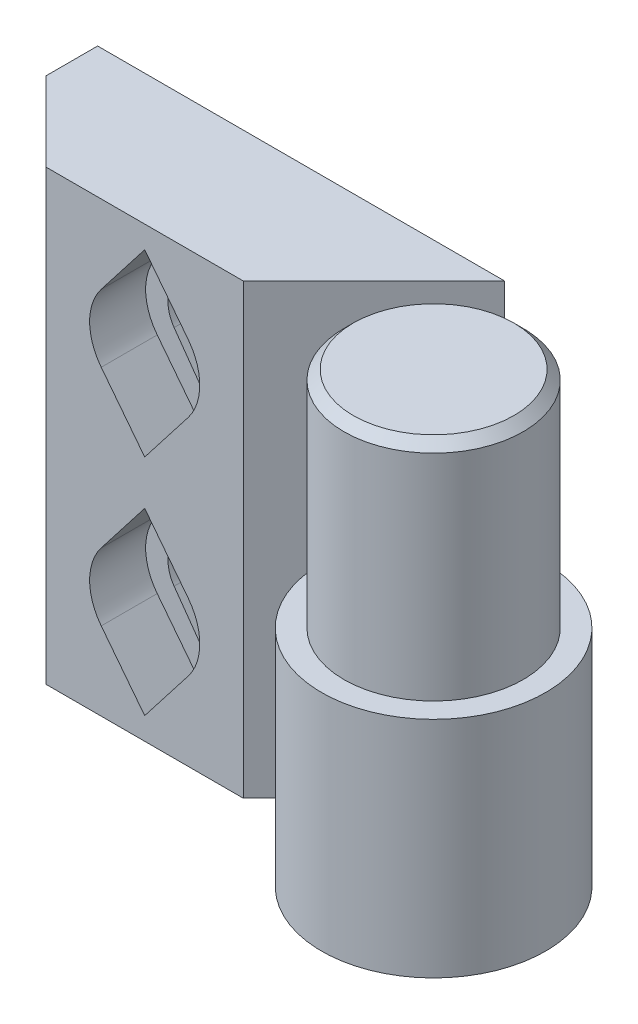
ISO-10303-21;
HEADER;
FILE_DESCRIPTION(('STEP AP214'),'2;1');
FILE_NAME('part.step','',(''),(''),'','','');
FILE_SCHEMA(('AUTOMOTIVE_DESIGN { 1 0 10303 214 1 1 1 1 }'));
ENDSEC;
DATA;
#1=APPLICATION_CONTEXT('core data for automotive mechanical design processes');
#2=APPLICATION_PROTOCOL_DEFINITION('international standard','automotive_design',2000,#1);
#3=PRODUCT_CONTEXT('',#1,'mechanical');
#4=PRODUCT('Part','Part','',(#3));
#5=PRODUCT_RELATED_PRODUCT_CATEGORY('part','',(#4));
#6=PRODUCT_DEFINITION_FORMATION('','',#4);
#7=PRODUCT_DEFINITION_CONTEXT('part definition',#1,'design');
#8=PRODUCT_DEFINITION('design','',#6,#7);
#9=PRODUCT_DEFINITION_SHAPE('','',#8);
#10=(LENGTH_UNIT() NAMED_UNIT(*) SI_UNIT(.MILLI.,.METRE.));
#11=(NAMED_UNIT(*) PLANE_ANGLE_UNIT() SI_UNIT($,.RADIAN.));
#12=(NAMED_UNIT(*) SI_UNIT($,.STERADIAN.) SOLID_ANGLE_UNIT());
#13=UNCERTAINTY_MEASURE_WITH_UNIT(LENGTH_MEASURE(1.E-05),#10,'distance_accuracy_value','');
#14=(GEOMETRIC_REPRESENTATION_CONTEXT(3) GLOBAL_UNCERTAINTY_ASSIGNED_CONTEXT((#13)) GLOBAL_UNIT_ASSIGNED_CONTEXT((#10,
#11,#12)) REPRESENTATION_CONTEXT('',''));
#15=CARTESIAN_POINT('',(0.,0.,0.));
#16=DIRECTION('',(0.,0.,1.));
#17=DIRECTION('',(1.,0.,0.));
#18=AXIS2_PLACEMENT_3D('',#15,#16,#17);
#19=CARTESIAN_POINT('',(0.,0.,-2.));
#20=DIRECTION('',(0.,0.,1.));
#21=DIRECTION('',(1.,0.,0.));
#22=AXIS2_PLACEMENT_3D('',#19,#20,#21);
#23=PLANE('',#22);
#24=DIRECTION('',(0.613374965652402,-0.789791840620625,0.));
#25=VECTOR('',#24,1.);
#26=CARTESIAN_POINT('',(2.01877343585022,1.56783727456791,-2.));
#27=LINE('',#26,#25);
#28=CARTESIAN_POINT('',(-14.4780762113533,22.8094561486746,-2.));
#29=VERTEX_POINT('',#28);
#30=CARTESIAN_POINT('',(-12.1481902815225,19.8094561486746,-2.));
#31=VERTEX_POINT('',#30);
#32=EDGE_CURVE('E336',#29,#31,#27,.T.);
#33=ORIENTED_EDGE('',*,*,#32,.F.);
#34=DIRECTION('',(0.613374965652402,0.789791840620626,0.));
#35=VECTOR('',#34,1.);
#36=CARTESIAN_POINT('',(-20.0807859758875,15.5953135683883,-2.));
#37=LINE('',#36,#35);
#38=CARTESIAN_POINT('',(-16.8079621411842,19.8094561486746,-2.));
#39=VERTEX_POINT('',#38);
#40=EDGE_CURVE('E338',#39,#29,#37,.T.);
#41=ORIENTED_EDGE('',*,*,#40,.F.);
#42=CARTESIAN_POINT('',(-14.4780762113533,18.,-2.));
#43=DIRECTION('',(0.,0.,1.));
#44=DIRECTION('',(1.,0.,0.));
#45=AXIS2_PLACEMENT_3D('',#42,#43,#44);
#46=CIRCLE('',#45,2.95);
#47=CARTESIAN_POINT('',(-16.8079621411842,16.1905438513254,-2.));
#48=VERTEX_POINT('',#47);
#49=EDGE_CURVE('E341',#39,#48,#46,.T.);
#50=ORIENTED_EDGE('',*,*,#49,.T.);
#51=DIRECTION('',(0.613374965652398,-0.789791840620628,0.));
#52=VECTOR('',#51,1.);
#53=CARTESIAN_POINT('',(-2.64099842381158,-2.05107502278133,-2.));
#54=LINE('',#53,#52);
#55=CARTESIAN_POINT('',(-14.4780762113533,13.1905438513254,-2.));
#56=VERTEX_POINT('',#55);
#57=EDGE_CURVE('E344',#48,#56,#54,.T.);
#58=ORIENTED_EDGE('',*,*,#57,.T.);
#59=DIRECTION('',(0.613374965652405,0.789791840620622,0.));
#60=VECTOR('',#59,1.);
#61=CARTESIAN_POINT('',(-15.4210141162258,11.9764012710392,-2.));
#62=LINE('',#61,#60);
#63=CARTESIAN_POINT('',(-12.1481902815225,16.1905438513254,-2.));
#64=VERTEX_POINT('',#63);
#65=EDGE_CURVE('E347',#56,#64,#62,.T.);
#66=ORIENTED_EDGE('',*,*,#65,.T.);
#67=CARTESIAN_POINT('',(-14.4780762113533,18.,-2.));
#68=DIRECTION('',(0.,0.,1.));
#69=DIRECTION('',(1.,0.,0.));
#70=AXIS2_PLACEMENT_3D('',#67,#68,#69);
#71=CIRCLE('',#70,2.95);
#72=EDGE_CURVE('E350',#64,#31,#71,.T.);
#73=ORIENTED_EDGE('',*,*,#72,.T.);
#74=EDGE_LOOP('',(#33,#41,#50,#58,#66,#73));
#75=FACE_BOUND('',#74,.T.);
#76=DIRECTION('',(0.580322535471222,0.814386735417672,0.));
#77=VECTOR('',#76,1.);
#78=CARTESIAN_POINT('',(-19.5343353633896,13.9199406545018,-2.));
#79=LINE('',#78,#77);
#80=CARTESIAN_POINT('',(-15.9032529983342,19.0155644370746,-2.));
#81=VERTEX_POINT('',#80);
#82=CARTESIAN_POINT('',(-14.4780762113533,21.0155644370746,-2.));
#83=VERTEX_POINT('',#82);
#84=EDGE_CURVE('E307',#81,#83,#79,.T.);
#85=ORIENTED_EDGE('',*,*,#84,.T.);
#86=DIRECTION('',(0.580322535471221,-0.814386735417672,0.));
#87=VECTOR('',#86,1.);
#88=CARTESIAN_POINT('',(0.32986931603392,0.235061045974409,-2.));
#89=LINE('',#88,#87);
#90=CARTESIAN_POINT('',(-13.0528994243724,19.0155644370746,-2.));
#91=VERTEX_POINT('',#90);
#92=EDGE_CURVE('E304',#83,#91,#89,.T.);
#93=ORIENTED_EDGE('',*,*,#92,.T.);
#94=CARTESIAN_POINT('',(-14.4780762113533,18.,-2.));
#95=DIRECTION('',(0.,0.,1.));
#96=DIRECTION('',(1.,0.,0.));
#97=AXIS2_PLACEMENT_3D('',#94,#95,#96);
#98=CIRCLE('',#97,1.75);
#99=CARTESIAN_POINT('',(-13.0528994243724,16.9844355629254,-2.));
#100=VERTEX_POINT('',#99);
#101=EDGE_CURVE('E317',#100,#91,#98,.T.);
#102=ORIENTED_EDGE('',*,*,#101,.F.);
#103=DIRECTION('',(0.580322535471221,0.814386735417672,0.));
#104=VECTOR('',#103,1.);
#105=CARTESIAN_POINT('',(-16.6839817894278,11.8888117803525,-2.));
#106=LINE('',#105,#104);
#107=CARTESIAN_POINT('',(-14.4780762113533,14.9844355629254,-2.));
#108=VERTEX_POINT('',#107);
#109=EDGE_CURVE('E55',#108,#100,#106,.T.);
#110=ORIENTED_EDGE('',*,*,#109,.F.);
#111=DIRECTION('',(0.580322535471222,-0.814386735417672,0.));
#112=VECTOR('',#111,1.);
#113=CARTESIAN_POINT('',(-2.52048425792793,-1.79606782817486,-2.));
#114=LINE('',#113,#112);
#115=CARTESIAN_POINT('',(-15.9032529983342,16.9844355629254,-2.));
#116=VERTEX_POINT('',#115);
#117=EDGE_CURVE('E313',#116,#108,#114,.T.);
#118=ORIENTED_EDGE('',*,*,#117,.F.);
#119=CARTESIAN_POINT('',(-14.4780762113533,18.,-2.));
#120=DIRECTION('',(0.,0.,1.));
#121=DIRECTION('',(1.,0.,0.));
#122=AXIS2_PLACEMENT_3D('',#119,#120,#121);
#123=CIRCLE('',#122,1.75);
#124=EDGE_CURVE('E310',#81,#116,#123,.T.);
#125=ORIENTED_EDGE('',*,*,#124,.F.);
#126=EDGE_LOOP('',(#85,#93,#102,#110,#118,#125));
#127=FACE_BOUND('',#126,.T.);
#128=ADVANCED_FACE('F40',(#75,#127),#23,.T.);
#129=CARTESIAN_POINT('',(-24.,36.1867732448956,-6.));
#130=DIRECTION('',(0.,0.,1.));
#131=DIRECTION('',(1.,0.,0.));
#132=AXIS2_PLACEMENT_3D('',#129,#130,#131);
#133=PLANE('',#132);
#134=DIRECTION('',(-0.580322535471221,0.814386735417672,0.));
#135=VECTOR('',#134,1.);
#136=CARTESIAN_POINT('',(0.32986931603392,0.235061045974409,-6.));
#137=LINE('',#136,#135);
#138=CARTESIAN_POINT('',(-13.0528994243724,19.0155644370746,-6.));
#139=VERTEX_POINT('',#138);
#140=CARTESIAN_POINT('',(-14.4780762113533,21.0155644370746,-6.));
#141=VERTEX_POINT('',#140);
#142=EDGE_CURVE('E301',#139,#141,#137,.T.);
#143=ORIENTED_EDGE('',*,*,#142,.T.);
#144=DIRECTION('',(-0.580322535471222,-0.814386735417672,0.));
#145=VECTOR('',#144,1.);
#146=CARTESIAN_POINT('',(-19.5343353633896,13.9199406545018,-6.));
#147=LINE('',#146,#145);
#148=CARTESIAN_POINT('',(-15.9032529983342,19.0155644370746,-6.));
#149=VERTEX_POINT('',#148);
#150=EDGE_CURVE('E323',#141,#149,#147,.T.);
#151=ORIENTED_EDGE('',*,*,#150,.T.);
#152=CARTESIAN_POINT('',(-14.4780762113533,18.,-6.));
#153=DIRECTION('',(0.,0.,1.));
#154=DIRECTION('',(1.,0.,0.));
#155=AXIS2_PLACEMENT_3D('',#152,#153,#154);
#156=CIRCLE('',#155,1.75);
#157=CARTESIAN_POINT('',(-15.9032529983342,16.9844355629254,-6.));
#158=VERTEX_POINT('',#157);
#159=EDGE_CURVE('E292',#158,#149,#156,.F.);
#160=ORIENTED_EDGE('',*,*,#159,.F.);
#161=DIRECTION('',(-0.580322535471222,0.814386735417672,0.));
#162=VECTOR('',#161,1.);
#163=CARTESIAN_POINT('',(-2.52048425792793,-1.79606782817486,-6.));
#164=LINE('',#163,#162);
#165=CARTESIAN_POINT('',(-14.4780762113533,14.9844355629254,-6.));
#166=VERTEX_POINT('',#165);
#167=EDGE_CURVE('E295',#166,#158,#164,.T.);
#168=ORIENTED_EDGE('',*,*,#167,.F.);
#169=DIRECTION('',(-0.580322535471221,-0.814386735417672,0.));
#170=VECTOR('',#169,1.);
#171=CARTESIAN_POINT('',(-16.6839817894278,11.8888117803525,-6.));
#172=LINE('',#171,#170);
#173=CARTESIAN_POINT('',(-13.0528994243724,16.9844355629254,-6.));
#174=VERTEX_POINT('',#173);
#175=EDGE_CURVE('E297',#174,#166,#172,.T.);
#176=ORIENTED_EDGE('',*,*,#175,.F.);
#177=CARTESIAN_POINT('',(-14.4780762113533,18.,-6.));
#178=DIRECTION('',(0.,0.,1.));
#179=DIRECTION('',(1.,0.,0.));
#180=AXIS2_PLACEMENT_3D('',#177,#178,#179);
#181=CIRCLE('',#180,1.75);
#182=EDGE_CURVE('E299',#139,#174,#181,.F.);
#183=ORIENTED_EDGE('',*,*,#182,.F.);
#184=EDGE_LOOP('',(#143,#151,#160,#168,#176,#183));
#185=FACE_BOUND('',#184,.T.);
#186=DIRECTION('',(-1.,0.,0.));
#187=VECTOR('',#186,1.);
#188=CARTESIAN_POINT('',(-24.,12.,-6.));
#189=LINE('',#188,#187);
#190=CARTESIAN_POINT('',(0.,12.,-6.));
#191=VERTEX_POINT('',#190);
#192=CARTESIAN_POINT('',(-2.19615242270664,12.,-6.));
#193=VERTEX_POINT('',#192);
#194=EDGE_CURVE('E461',#191,#193,#189,.T.);
#195=ORIENTED_EDGE('',*,*,#194,.F.);
#196=DIRECTION('',(0.,-1.,0.));
#197=VECTOR('',#196,1.);
#198=CARTESIAN_POINT('',(0.,36.1867732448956,-6.));
#199=LINE('',#198,#197);
#200=CARTESIAN_POINT('',(0.,0.,-6.));
#201=VERTEX_POINT('',#200);
#202=EDGE_CURVE('E444',#191,#201,#199,.T.);
#203=ORIENTED_EDGE('',*,*,#202,.T.);
#204=DIRECTION('',(-1.,0.,0.));
#205=VECTOR('',#204,1.);
#206=CARTESIAN_POINT('',(-24.,0.,-6.));
#207=LINE('',#206,#205);
#208=CARTESIAN_POINT('',(-24.,0.,-6.));
#209=VERTEX_POINT('',#208);
#210=EDGE_CURVE('E458',#201,#209,#207,.T.);
#211=ORIENTED_EDGE('',*,*,#210,.T.);
#212=DIRECTION('',(0.,-1.,0.));
#213=VECTOR('',#212,1.);
#214=CARTESIAN_POINT('',(-24.,36.1867732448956,-6.));
#215=LINE('',#214,#213);
#216=CARTESIAN_POINT('',(-24.,24.,-6.));
#217=VERTEX_POINT('',#216);
#218=EDGE_CURVE('E457',#217,#209,#215,.T.);
#219=ORIENTED_EDGE('',*,*,#218,.F.);
#220=DIRECTION('',(-1.,0.,0.));
#221=VECTOR('',#220,1.);
#222=CARTESIAN_POINT('',(-2.19615242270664,24.,-6.));
#223=LINE('',#222,#221);
#224=CARTESIAN_POINT('',(-2.19615242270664,24.,-6.));
#225=VERTEX_POINT('',#224);
#226=EDGE_CURVE('E448',#225,#217,#223,.T.);
#227=ORIENTED_EDGE('',*,*,#226,.F.);
#228=DIRECTION('',(0.,-1.,0.));
#229=VECTOR('',#228,1.);
#230=CARTESIAN_POINT('',(-2.19615242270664,46.0092655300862,-6.));
#231=LINE('',#230,#229);
#232=EDGE_CURVE('E440',#225,#193,#231,.T.);
#233=ORIENTED_EDGE('',*,*,#232,.T.);
#234=EDGE_LOOP('',(#195,#203,#211,#219,#227,#233));
#235=FACE_BOUND('',#234,.T.);
#236=CARTESIAN_POINT('',(-14.4780762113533,6.,-6.));
#237=DIRECTION('',(0.,0.,1.));
#238=DIRECTION('',(1.,0.,0.));
#239=AXIS2_PLACEMENT_3D('',#236,#237,#238);
#240=CIRCLE('',#239,1.75);
#241=CARTESIAN_POINT('',(-13.0528994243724,4.98443556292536,-6.));
#242=VERTEX_POINT('',#241);
#243=CARTESIAN_POINT('',(-13.0528994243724,7.01556443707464,-6.));
#244=VERTEX_POINT('',#243);
#245=EDGE_CURVE('E255',#242,#244,#240,.T.);
#246=ORIENTED_EDGE('',*,*,#245,.T.);
#247=DIRECTION('',(-0.580322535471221,0.814386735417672,0.));
#248=VECTOR('',#247,1.);
#249=CARTESIAN_POINT('',(-5.34141438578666,-3.80622989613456,-6.));
#250=LINE('',#249,#248);
#251=CARTESIAN_POINT('',(-14.4780762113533,9.01556443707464,-6.));
#252=VERTEX_POINT('',#251);
#253=EDGE_CURVE('E242',#244,#252,#250,.T.);
#254=ORIENTED_EDGE('',*,*,#253,.T.);
#255=DIRECTION('',(-0.580322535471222,-0.814386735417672,0.));
#256=VECTOR('',#255,1.);
#257=CARTESIAN_POINT('',(-13.8630516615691,9.8786497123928,-6.));
#258=LINE('',#257,#256);
#259=CARTESIAN_POINT('',(-15.9032529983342,7.01556443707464,-6.));
#260=VERTEX_POINT('',#259);
#261=EDGE_CURVE('E335',#252,#260,#258,.T.);
#262=ORIENTED_EDGE('',*,*,#261,.T.);
#263=CARTESIAN_POINT('',(-14.4780762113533,6.,-6.));
#264=DIRECTION('',(0.,0.,1.));
#265=DIRECTION('',(1.,0.,0.));
#266=AXIS2_PLACEMENT_3D('',#263,#264,#265);
#267=CIRCLE('',#266,1.75);
#268=CARTESIAN_POINT('',(-15.9032529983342,4.98443556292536,-6.));
#269=VERTEX_POINT('',#268);
#270=EDGE_CURVE('E665',#260,#269,#267,.T.);
#271=ORIENTED_EDGE('',*,*,#270,.T.);
#272=DIRECTION('',(-0.580322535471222,0.814386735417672,0.));
#273=VECTOR('',#272,1.);
#274=CARTESIAN_POINT('',(-8.1917679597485,-5.83735877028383,-6.));
#275=LINE('',#274,#273);
#276=CARTESIAN_POINT('',(-14.4780762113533,2.98443556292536,-6.));
#277=VERTEX_POINT('',#276);
#278=EDGE_CURVE('E268',#277,#269,#275,.T.);
#279=ORIENTED_EDGE('',*,*,#278,.F.);
#280=DIRECTION('',(-0.580322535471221,-0.814386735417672,0.));
#281=VECTOR('',#280,1.);
#282=CARTESIAN_POINT('',(-11.0126980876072,7.84752083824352,-6.));
#283=LINE('',#282,#281);
#284=EDGE_CURVE('E264',#242,#277,#283,.T.);
#285=ORIENTED_EDGE('',*,*,#284,.F.);
#286=EDGE_LOOP('',(#246,#254,#262,#271,#279,#285));
#287=FACE_BOUND('',#286,.T.);
#288=ADVANCED_FACE('F262',(#185,#235,#287),#133,.F.);
#289=CARTESIAN_POINT('',(-14.4780762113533,6.,-2.));
#290=DIRECTION('',(0.,0.,-1.));
#291=DIRECTION('',(-1.,0.,0.));
#292=AXIS2_PLACEMENT_3D('',#289,#290,#291);
#293=PLANE('',#292);
#294=DIRECTION('',(0.613374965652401,-0.789791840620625,0.));
#295=VECTOR('',#294,1.);
#296=CARTESIAN_POINT('',(-16.8079621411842,4.19054385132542,-2.));
#297=LINE('',#296,#295);
#298=CARTESIAN_POINT('',(-16.8079621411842,4.19054385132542,-2.));
#299=VERTEX_POINT('',#298);
#300=CARTESIAN_POINT('',(-14.4780762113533,1.19054385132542,-2.));
#301=VERTEX_POINT('',#300);
#302=EDGE_CURVE('E402',#299,#301,#297,.T.);
#303=ORIENTED_EDGE('',*,*,#302,.T.);
#304=DIRECTION('',(0.613374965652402,0.789791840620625,0.));
#305=VECTOR('',#304,1.);
#306=CARTESIAN_POINT('',(-14.4780762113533,1.19054385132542,-2.));
#307=LINE('',#306,#305);
#308=CARTESIAN_POINT('',(-12.1481902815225,4.19054385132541,-2.));
#309=VERTEX_POINT('',#308);
#310=EDGE_CURVE('E422',#301,#309,#307,.T.);
#311=ORIENTED_EDGE('',*,*,#310,.T.);
#312=CARTESIAN_POINT('',(-14.4780762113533,6.,-2.));
#313=DIRECTION('',(0.,0.,-1.));
#314=DIRECTION('',(-1.,0.,0.));
#315=AXIS2_PLACEMENT_3D('',#312,#313,#314);
#316=CIRCLE('',#315,2.95);
#317=CARTESIAN_POINT('',(-12.1481902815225,7.8094561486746,-2.));
#318=VERTEX_POINT('',#317);
#319=EDGE_CURVE('E420',#318,#309,#316,.T.);
#320=ORIENTED_EDGE('',*,*,#319,.F.);
#321=DIRECTION('',(0.613374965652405,-0.789791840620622,0.));
#322=VECTOR('',#321,1.);
#323=CARTESIAN_POINT('',(-14.4780762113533,10.8094561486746,-2.));
#324=LINE('',#323,#322);
#325=CARTESIAN_POINT('',(-14.4780762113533,10.8094561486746,-2.));
#326=VERTEX_POINT('',#325);
#327=EDGE_CURVE('E418',#326,#318,#324,.T.);
#328=ORIENTED_EDGE('',*,*,#327,.F.);
#329=DIRECTION('',(0.613374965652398,0.789791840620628,0.));
#330=VECTOR('',#329,1.);
#331=CARTESIAN_POINT('',(-16.8079621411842,7.80945614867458,-2.));
#332=LINE('',#331,#330);
#333=CARTESIAN_POINT('',(-16.8079621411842,7.80945614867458,-2.));
#334=VERTEX_POINT('',#333);
#335=EDGE_CURVE('E416',#334,#326,#332,.T.);
#336=ORIENTED_EDGE('',*,*,#335,.F.);
#337=CARTESIAN_POINT('',(-14.4780762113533,6.,-2.));
#338=DIRECTION('',(0.,0.,-1.));
#339=DIRECTION('',(-1.,0.,0.));
#340=AXIS2_PLACEMENT_3D('',#337,#338,#339);
#341=CIRCLE('',#340,2.95);
#342=EDGE_CURVE('E388',#299,#334,#341,.T.);
#343=ORIENTED_EDGE('',*,*,#342,.F.);
#344=EDGE_LOOP('',(#303,#311,#320,#328,#336,#343));
#345=FACE_BOUND('',#344,.T.);
#346=CARTESIAN_POINT('',(-14.4780762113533,6.,-2.));
#347=DIRECTION('',(0.,0.,1.));
#348=DIRECTION('',(1.,0.,0.));
#349=AXIS2_PLACEMENT_3D('',#346,#347,#348);
#350=CIRCLE('',#349,1.75);
#351=CARTESIAN_POINT('',(-13.0528994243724,7.01556443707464,-2.));
#352=VERTEX_POINT('',#351);
#353=CARTESIAN_POINT('',(-13.0528994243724,4.98443556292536,-2.));
#354=VERTEX_POINT('',#353);
#355=EDGE_CURVE('E258',#352,#354,#350,.F.);
#356=ORIENTED_EDGE('',*,*,#355,.T.);
#357=DIRECTION('',(0.580322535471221,0.814386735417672,0.));
#358=VECTOR('',#357,1.);
#359=CARTESIAN_POINT('',(-11.0126980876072,7.84752083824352,-2.));
#360=LINE('',#359,#358);
#361=CARTESIAN_POINT('',(-14.4780762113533,2.98443556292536,-2.));
#362=VERTEX_POINT('',#361);
#363=EDGE_CURVE('E259',#362,#354,#360,.T.);
#364=ORIENTED_EDGE('',*,*,#363,.F.);
#365=DIRECTION('',(0.580322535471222,-0.814386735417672,0.));
#366=VECTOR('',#365,1.);
#367=CARTESIAN_POINT('',(-8.1917679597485,-5.83735877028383,-2.));
#368=LINE('',#367,#366);
#369=CARTESIAN_POINT('',(-15.9032529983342,4.98443556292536,-2.));
#370=VERTEX_POINT('',#369);
#371=EDGE_CURVE('E279',#370,#362,#368,.T.);
#372=ORIENTED_EDGE('',*,*,#371,.F.);
#373=CARTESIAN_POINT('',(-14.4780762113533,6.,-2.));
#374=DIRECTION('',(0.,0.,1.));
#375=DIRECTION('',(1.,0.,0.));
#376=AXIS2_PLACEMENT_3D('',#373,#374,#375);
#377=CIRCLE('',#376,1.75);
#378=CARTESIAN_POINT('',(-15.9032529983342,7.01556443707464,-2.));
#379=VERTEX_POINT('',#378);
#380=EDGE_CURVE('E276',#370,#379,#377,.F.);
#381=ORIENTED_EDGE('',*,*,#380,.T.);
#382=DIRECTION('',(0.580322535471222,0.814386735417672,0.));
#383=VECTOR('',#382,1.);
#384=CARTESIAN_POINT('',(-13.8630516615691,9.8786497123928,-2.));
#385=LINE('',#384,#383);
#386=CARTESIAN_POINT('',(-14.4780762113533,9.01556443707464,-2.));
#387=VERTEX_POINT('',#386);
#388=EDGE_CURVE('E273',#379,#387,#385,.T.);
#389=ORIENTED_EDGE('',*,*,#388,.T.);
#390=DIRECTION('',(0.580322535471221,-0.814386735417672,0.));
#391=VECTOR('',#390,1.);
#392=CARTESIAN_POINT('',(-5.34141438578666,-3.80622989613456,-2.));
#393=LINE('',#392,#391);
#394=EDGE_CURVE('E266',#387,#352,#393,.T.);
#395=ORIENTED_EDGE('',*,*,#394,.T.);
#396=EDGE_LOOP('',(#356,#364,#372,#381,#389,#395));
#397=FACE_BOUND('',#396,.T.);
#398=ADVANCED_FACE('F518',(#345,#397),#293,.F.);
#399=CARTESIAN_POINT('',(-9.19615242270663,43.2245853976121,0.999999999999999));
#400=DIRECTION('',(0.,0.,1.));
#401=DIRECTION('',(1.,0.,0.));
#402=AXIS2_PLACEMENT_3D('',#399,#400,#401);
#403=PLANE('',#402);
#404=DIRECTION('',(0.613374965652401,-0.789791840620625,0.));
#405=VECTOR('',#404,1.);
#406=CARTESIAN_POINT('',(-16.8079621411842,4.19054385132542,1.));
#407=LINE('',#406,#405);
#408=CARTESIAN_POINT('',(-16.8079621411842,4.19054385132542,1.));
#409=VERTEX_POINT('',#408);
#410=CARTESIAN_POINT('',(-14.4780762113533,1.19054385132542,0.999999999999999));
#411=VERTEX_POINT('',#410);
#412=EDGE_CURVE('E358',#409,#411,#407,.T.);
#413=ORIENTED_EDGE('',*,*,#412,.F.);
#414=CARTESIAN_POINT('',(-14.4780762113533,6.,1.));
#415=DIRECTION('',(0.,0.,-1.));
#416=DIRECTION('',(-1.,0.,0.));
#417=AXIS2_PLACEMENT_3D('',#414,#415,#416);
#418=CIRCLE('',#417,2.95);
#419=CARTESIAN_POINT('',(-16.8079621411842,7.80945614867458,1.));
#420=VERTEX_POINT('',#419);
#421=EDGE_CURVE('E398',#409,#420,#418,.T.);
#422=ORIENTED_EDGE('',*,*,#421,.T.);
#423=DIRECTION('',(0.613374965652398,0.789791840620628,0.));
#424=VECTOR('',#423,1.);
#425=CARTESIAN_POINT('',(-16.8079621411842,7.80945614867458,1.));
#426=LINE('',#425,#424);
#427=CARTESIAN_POINT('',(-14.4780762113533,10.8094561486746,1.));
#428=VERTEX_POINT('',#427);
#429=EDGE_CURVE('E401',#420,#428,#426,.T.);
#430=ORIENTED_EDGE('',*,*,#429,.T.);
#431=DIRECTION('',(0.613374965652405,-0.789791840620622,0.));
#432=VECTOR('',#431,1.);
#433=CARTESIAN_POINT('',(-14.4780762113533,10.8094561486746,1.));
#434=LINE('',#433,#432);
#435=CARTESIAN_POINT('',(-12.1481902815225,7.8094561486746,1.));
#436=VERTEX_POINT('',#435);
#437=EDGE_CURVE('E405',#428,#436,#434,.T.);
#438=ORIENTED_EDGE('',*,*,#437,.T.);
#439=CARTESIAN_POINT('',(-14.4780762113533,6.,1.));
#440=DIRECTION('',(0.,0.,-1.));
#441=DIRECTION('',(-1.,0.,0.));
#442=AXIS2_PLACEMENT_3D('',#439,#440,#441);
#443=CIRCLE('',#442,2.95);
#444=CARTESIAN_POINT('',(-12.1481902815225,4.19054385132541,1.));
#445=VERTEX_POINT('',#444);
#446=EDGE_CURVE('E408',#436,#445,#443,.T.);
#447=ORIENTED_EDGE('',*,*,#446,.T.);
#448=DIRECTION('',(0.613374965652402,0.789791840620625,0.));
#449=VECTOR('',#448,1.);
#450=CARTESIAN_POINT('',(-14.4780762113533,1.19054385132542,1.));
#451=LINE('',#450,#449);
#452=EDGE_CURVE('E411',#411,#445,#451,.T.);
#453=ORIENTED_EDGE('',*,*,#452,.F.);
#454=EDGE_LOOP('',(#413,#422,#430,#438,#447,#453));
#455=FACE_BOUND('',#454,.T.);
#456=DIRECTION('',(-1.,0.,0.));
#457=VECTOR('',#456,1.);
#458=CARTESIAN_POINT('',(-9.19615242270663,24.,0.999999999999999));
#459=LINE('',#458,#457);
#460=CARTESIAN_POINT('',(-9.19615242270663,24.,0.999999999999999));
#461=VERTEX_POINT('',#460);
#462=CARTESIAN_POINT('',(-19.76,24.,0.999999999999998));
#463=VERTEX_POINT('',#462);
#464=EDGE_CURVE('E433',#461,#463,#459,.T.);
#465=ORIENTED_EDGE('',*,*,#464,.T.);
#466=DIRECTION('',(0.,-1.,0.));
#467=VECTOR('',#466,1.);
#468=CARTESIAN_POINT('',(-19.76,0.,0.999999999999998));
#469=LINE('',#468,#467);
#470=CARTESIAN_POINT('',(-19.76,0.,0.999999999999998));
#471=VERTEX_POINT('',#470);
#472=EDGE_CURVE('E482',#463,#471,#469,.T.);
#473=ORIENTED_EDGE('',*,*,#472,.T.);
#474=DIRECTION('',(-1.,0.,0.));
#475=VECTOR('',#474,1.);
#476=CARTESIAN_POINT('',(-9.19615242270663,0.,0.999999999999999));
#477=LINE('',#476,#475);
#478=CARTESIAN_POINT('',(-9.19615242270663,0.,0.999999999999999));
#479=VERTEX_POINT('',#478);
#480=EDGE_CURVE('E427',#479,#471,#477,.T.);
#481=ORIENTED_EDGE('',*,*,#480,.F.);
#482=DIRECTION('',(0.,-1.,0.));
#483=VECTOR('',#482,1.);
#484=CARTESIAN_POINT('',(-9.19615242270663,43.2245853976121,0.999999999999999));
#485=LINE('',#484,#483);
#486=EDGE_CURVE('E430',#461,#479,#485,.T.);
#487=ORIENTED_EDGE('',*,*,#486,.F.);
#488=EDGE_LOOP('',(#465,#473,#481,#487));
#489=FACE_BOUND('',#488,.T.);
#490=DIRECTION('',(0.613374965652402,0.789791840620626,0.));
#491=VECTOR('',#490,1.);
#492=CARTESIAN_POINT('',(-20.0807859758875,15.5953135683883,1.));
#493=LINE('',#492,#491);
#494=CARTESIAN_POINT('',(-16.8079621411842,19.8094561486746,1.));
#495=VERTEX_POINT('',#494);
#496=CARTESIAN_POINT('',(-14.4780762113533,22.8094561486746,0.999999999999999));
#497=VERTEX_POINT('',#496);
#498=EDGE_CURVE('E357',#495,#497,#493,.T.);
#499=ORIENTED_EDGE('',*,*,#498,.T.);
#500=DIRECTION('',(0.613374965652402,-0.789791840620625,0.));
#501=VECTOR('',#500,1.);
#502=CARTESIAN_POINT('',(2.01877343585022,1.56783727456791,1.));
#503=LINE('',#502,#501);
#504=CARTESIAN_POINT('',(-12.1481902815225,19.8094561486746,1.));
#505=VERTEX_POINT('',#504);
#506=EDGE_CURVE('E354',#497,#505,#503,.T.);
#507=ORIENTED_EDGE('',*,*,#506,.T.);
#508=CARTESIAN_POINT('',(-14.4780762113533,18.,1.));
#509=DIRECTION('',(0.,0.,1.));
#510=DIRECTION('',(1.,0.,0.));
#511=AXIS2_PLACEMENT_3D('',#508,#509,#510);
#512=CIRCLE('',#511,2.95);
#513=CARTESIAN_POINT('',(-12.1481902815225,16.1905438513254,1.));
#514=VERTEX_POINT('',#513);
#515=EDGE_CURVE('E339',#514,#505,#512,.T.);
#516=ORIENTED_EDGE('',*,*,#515,.F.);
#517=DIRECTION('',(0.613374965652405,0.789791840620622,0.));
#518=VECTOR('',#517,1.);
#519=CARTESIAN_POINT('',(-15.4210141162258,11.9764012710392,1.));
#520=LINE('',#519,#518);
#521=CARTESIAN_POINT('',(-14.4780762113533,13.1905438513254,1.));
#522=VERTEX_POINT('',#521);
#523=EDGE_CURVE('E367',#522,#514,#520,.T.);
#524=ORIENTED_EDGE('',*,*,#523,.F.);
#525=DIRECTION('',(0.613374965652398,-0.789791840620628,0.));
#526=VECTOR('',#525,1.);
#527=CARTESIAN_POINT('',(-2.64099842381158,-2.05107502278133,1.));
#528=LINE('',#527,#526);
#529=CARTESIAN_POINT('',(-16.8079621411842,16.1905438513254,1.));
#530=VERTEX_POINT('',#529);
#531=EDGE_CURVE('E364',#530,#522,#528,.T.);
#532=ORIENTED_EDGE('',*,*,#531,.F.);
#533=CARTESIAN_POINT('',(-14.4780762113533,18.,1.));
#534=DIRECTION('',(0.,0.,1.));
#535=DIRECTION('',(1.,0.,0.));
#536=AXIS2_PLACEMENT_3D('',#533,#534,#535);
#537=CIRCLE('',#536,2.95);
#538=EDGE_CURVE('E361',#495,#530,#537,.T.);
#539=ORIENTED_EDGE('',*,*,#538,.F.);
#540=EDGE_LOOP('',(#499,#507,#516,#524,#532,#539));
#541=FACE_BOUND('',#540,.T.);
#542=ADVANCED_FACE('F500',(#455,#489,#541),#403,.T.);
#543=CARTESIAN_POINT('',(0.,12.,0.));
#544=DIRECTION('',(0.,1.,0.));
#545=DIRECTION('',(0.,0.,1.));
#546=AXIS2_PLACEMENT_3D('',#543,#544,#545);
#547=PLANE('',#546);
#548=CARTESIAN_POINT('',(0.,12.,0.));
#549=DIRECTION('',(0.,1.,0.));
#550=DIRECTION('',(0.,0.,1.));
#551=AXIS2_PLACEMENT_3D('',#548,#549,#550);
#552=CIRCLE('',#551,4.8);
#553=CARTESIAN_POINT('',(0.,12.,4.8));
#554=VERTEX_POINT('',#553);
#555=EDGE_CURVE('E469',#554,#554,#552,.T.);
#556=ORIENTED_EDGE('',*,*,#555,.F.);
#557=EDGE_LOOP('',(#556));
#558=FACE_BOUND('',#557,.T.);
#559=ORIENTED_EDGE('',*,*,#194,.T.);
#560=DIRECTION('',(0.707106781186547,0.,-0.707106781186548));
#561=VECTOR('',#560,1.);
#562=CARTESIAN_POINT('',(-5.19615242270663,12.,-3.));
#563=LINE('',#562,#561);
#564=CARTESIAN_POINT('',(-5.19615242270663,12.,-3.));
#565=VERTEX_POINT('',#564);
#566=EDGE_CURVE('E436',#565,#193,#563,.T.);
#567=ORIENTED_EDGE('',*,*,#566,.F.);
#568=CARTESIAN_POINT('',(0.,12.,0.));
#569=DIRECTION('',(0.,1.,0.));
#570=DIRECTION('',(0.,0.,1.));
#571=AXIS2_PLACEMENT_3D('',#568,#569,#570);
#572=CIRCLE('',#571,6.);
#573=EDGE_CURVE('E473',#565,#191,#572,.T.);
#574=ORIENTED_EDGE('',*,*,#573,.T.);
#575=EDGE_LOOP('',(#559,#567,#574));
#576=FACE_BOUND('',#575,.T.);
#577=ADVANCED_FACE('F515',(#558,#576),#547,.T.);
#578=CARTESIAN_POINT('',(0.,12.,0.));
#579=DIRECTION('',(0.,-1.,0.));
#580=DIRECTION('',(0.,0.,-1.));
#581=AXIS2_PLACEMENT_3D('',#578,#579,#580);
#582=CYLINDRICAL_SURFACE('',#581,6.);
#583=ORIENTED_EDGE('',*,*,#202,.F.);
#584=ORIENTED_EDGE('',*,*,#573,.F.);
#585=DIRECTION('',(0.,-1.,0.));
#586=VECTOR('',#585,1.);
#587=CARTESIAN_POINT('',(-5.19615242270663,36.1867732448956,-3.));
#588=LINE('',#587,#586);
#589=CARTESIAN_POINT('',(-5.19615242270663,0.,-3.));
#590=VERTEX_POINT('',#589);
#591=EDGE_CURVE('E456',#565,#590,#588,.T.);
#592=ORIENTED_EDGE('',*,*,#591,.T.);
#593=CARTESIAN_POINT('',(0.,0.,0.));
#594=DIRECTION('',(0.,1.,0.));
#595=DIRECTION('',(0.,0.,1.));
#596=AXIS2_PLACEMENT_3D('',#593,#594,#595);
#597=CIRCLE('',#596,6.);
#598=EDGE_CURVE('E463',#590,#201,#597,.T.);
#599=ORIENTED_EDGE('',*,*,#598,.T.);
#600=EDGE_LOOP('',(#583,#584,#592,#599));
#601=FACE_BOUND('',#600,.T.);
#602=ADVANCED_FACE('F511',(#601),#582,.T.);
#603=CARTESIAN_POINT('',(0.,0.,0.));
#604=DIRECTION('',(0.,1.,0.));
#605=DIRECTION('',(0.,0.,1.));
#606=AXIS2_PLACEMENT_3D('',#603,#604,#605);
#607=PLANE('',#606);
#608=ORIENTED_EDGE('',*,*,#480,.T.);
#609=DIRECTION('',(-0.707106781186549,0.,-0.707106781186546));
#610=VECTOR('',#609,1.);
#611=CARTESIAN_POINT('',(-19.76,0.,0.999999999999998));
#612=LINE('',#611,#610);
#613=CARTESIAN_POINT('',(-24.,0.,-3.23999999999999));
#614=VERTEX_POINT('',#613);
#615=EDGE_CURVE('E485',#471,#614,#612,.T.);
#616=ORIENTED_EDGE('',*,*,#615,.T.);
#617=DIRECTION('',(0.,0.,1.));
#618=VECTOR('',#617,1.);
#619=CARTESIAN_POINT('',(-24.,0.,-6.));
#620=LINE('',#619,#618);
#621=EDGE_CURVE('E453',#209,#614,#620,.T.);
#622=ORIENTED_EDGE('',*,*,#621,.F.);
#623=ORIENTED_EDGE('',*,*,#210,.F.);
#624=ORIENTED_EDGE('',*,*,#598,.F.);
#625=DIRECTION('',(-0.707106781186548,0.,0.707106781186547));
#626=VECTOR('',#625,1.);
#627=CARTESIAN_POINT('',(-5.19615242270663,0.,-3.));
#628=LINE('',#627,#626);
#629=EDGE_CURVE('E374',#590,#479,#628,.T.);
#630=ORIENTED_EDGE('',*,*,#629,.T.);
#631=EDGE_LOOP('',(#608,#616,#622,#623,#624,#630));
#632=FACE_BOUND('',#631,.T.);
#633=ADVANCED_FACE('F504',(#632),#607,.F.);
#634=CARTESIAN_POINT('',(0.,24.,0.));
#635=DIRECTION('',(0.,-1.,0.));
#636=DIRECTION('',(0.,0.,-1.));
#637=AXIS2_PLACEMENT_3D('',#634,#635,#636);
#638=CYLINDRICAL_SURFACE('',#637,4.8);
#639=CARTESIAN_POINT('',(0.,23.5,0.));
#640=DIRECTION('',(0.,1.,0.));
#641=DIRECTION('',(0.,0.,1.));
#642=AXIS2_PLACEMENT_3D('',#639,#640,#641);
#643=CIRCLE('',#642,4.8);
#644=CARTESIAN_POINT('',(0.,23.5,4.8));
#645=VERTEX_POINT('',#644);
#646=EDGE_CURVE('E479',#645,#645,#643,.F.);
#647=ORIENTED_EDGE('',*,*,#646,.T.);
#648=EDGE_LOOP('',(#647));
#649=FACE_BOUND('',#648,.T.);
#650=ORIENTED_EDGE('',*,*,#555,.T.);
#651=EDGE_LOOP('',(#650));
#652=FACE_BOUND('',#651,.T.);
#653=ADVANCED_FACE('F536',(#649,#652),#638,.T.);
#654=CARTESIAN_POINT('',(0.,24.,0.));
#655=DIRECTION('',(0.,1.,0.));
#656=DIRECTION('',(0.,0.,1.));
#657=AXIS2_PLACEMENT_3D('',#654,#655,#656);
#658=PLANE('',#657);
#659=CARTESIAN_POINT('',(0.,24.,0.));
#660=DIRECTION('',(0.,1.,0.));
#661=DIRECTION('',(0.,0.,1.));
#662=AXIS2_PLACEMENT_3D('',#659,#660,#661);
#663=CIRCLE('',#662,4.30000000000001);
#664=CARTESIAN_POINT('',(0.,24.,4.30000000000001));
#665=VERTEX_POINT('',#664);
#666=EDGE_CURVE('E472',#665,#665,#663,.T.);
#667=ORIENTED_EDGE('',*,*,#666,.T.);
#668=EDGE_LOOP('',(#667));
#669=FACE_BOUND('',#668,.T.);
#670=ADVANCED_FACE('F532',(#669),#658,.T.);
#671=CARTESIAN_POINT('',(0.,24.,0.));
#672=DIRECTION('',(0.,-1.,0.));
#673=DIRECTION('',(0.,0.,-1.));
#674=AXIS2_PLACEMENT_3D('',#671,#672,#673);
#675=CONICAL_SURFACE('',#674,4.30000000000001,0.785398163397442);
#676=ORIENTED_EDGE('',*,*,#646,.F.);
#677=EDGE_LOOP('',(#676));
#678=FACE_BOUND('',#677,.T.);
#679=ORIENTED_EDGE('',*,*,#666,.F.);
#680=EDGE_LOOP('',(#679));
#681=FACE_BOUND('',#680,.T.);
#682=ADVANCED_FACE('F535',(#678,#681),#675,.T.);
#683=CARTESIAN_POINT('',(-24.,36.1867732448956,-6.));
#684=DIRECTION('',(1.,0.,0.));
#685=DIRECTION('',(0.,0.,-1.));
#686=AXIS2_PLACEMENT_3D('',#683,#684,#685);
#687=PLANE('',#686);
#688=ORIENTED_EDGE('',*,*,#621,.T.);
#689=DIRECTION('',(0.,1.,0.));
#690=VECTOR('',#689,1.);
#691=CARTESIAN_POINT('',(-24.,24.,-3.23999999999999));
#692=LINE('',#691,#690);
#693=CARTESIAN_POINT('',(-24.,24.,-3.23999999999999));
#694=VERTEX_POINT('',#693);
#695=EDGE_CURVE('E48',#614,#694,#692,.T.);
#696=ORIENTED_EDGE('',*,*,#695,.T.);
#697=DIRECTION('',(0.,0.,1.));
#698=VECTOR('',#697,1.);
#699=CARTESIAN_POINT('',(-24.,24.,-6.));
#700=LINE('',#699,#698);
#701=EDGE_CURVE('E445',#217,#694,#700,.T.);
#702=ORIENTED_EDGE('',*,*,#701,.F.);
#703=ORIENTED_EDGE('',*,*,#218,.T.);
#704=EDGE_LOOP('',(#688,#696,#702,#703));
#705=FACE_BOUND('',#704,.T.);
#706=ADVANCED_FACE('F489',(#705),#687,.F.);
#707=CARTESIAN_POINT('',(-5.19615242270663,46.0092655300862,-3.));
#708=DIRECTION('',(-0.707106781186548,0.,-0.707106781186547));
#709=DIRECTION('',(-0.707106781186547,0.,0.707106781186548));
#710=AXIS2_PLACEMENT_3D('',#707,#708,#709);
#711=PLANE('',#710);
#712=DIRECTION('',(0.707106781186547,0.,-0.707106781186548));
#713=VECTOR('',#712,1.);
#714=CARTESIAN_POINT('',(-5.19615242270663,24.,-3.));
#715=LINE('',#714,#713);
#716=EDGE_CURVE('E441',#461,#225,#715,.T.);
#717=ORIENTED_EDGE('',*,*,#716,.F.);
#718=ORIENTED_EDGE('',*,*,#486,.T.);
#719=ORIENTED_EDGE('',*,*,#629,.F.);
#720=ORIENTED_EDGE('',*,*,#591,.F.);
#721=ORIENTED_EDGE('',*,*,#566,.T.);
#722=ORIENTED_EDGE('',*,*,#232,.F.);
#723=EDGE_LOOP('',(#717,#718,#719,#720,#721,#722));
#724=FACE_BOUND('',#723,.T.);
#725=ADVANCED_FACE('F508',(#724),#711,.F.);
#726=CARTESIAN_POINT('',(0.,24.,0.));
#727=DIRECTION('',(0.,1.,0.));
#728=DIRECTION('',(0.,0.,1.));
#729=AXIS2_PLACEMENT_3D('',#726,#727,#728);
#730=PLANE('',#729);
#731=ORIENTED_EDGE('',*,*,#701,.T.);
#732=DIRECTION('',(0.707106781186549,0.,0.707106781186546));
#733=VECTOR('',#732,1.);
#734=CARTESIAN_POINT('',(-10.3799999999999,24.,10.38));
#735=LINE('',#734,#733);
#736=EDGE_CURVE('E11',#694,#463,#735,.T.);
#737=ORIENTED_EDGE('',*,*,#736,.T.);
#738=ORIENTED_EDGE('',*,*,#464,.F.);
#739=ORIENTED_EDGE('',*,*,#716,.T.);
#740=ORIENTED_EDGE('',*,*,#226,.T.);
#741=EDGE_LOOP('',(#731,#737,#738,#739,#740));
#742=FACE_BOUND('',#741,.T.);
#743=ADVANCED_FACE('F494',(#742),#730,.T.);
#744=CARTESIAN_POINT('',(-19.76,43.2245853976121,0.999999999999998));
#745=DIRECTION('',(-0.707106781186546,0.,0.707106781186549));
#746=DIRECTION('',(0.,1.,0.));
#747=AXIS2_PLACEMENT_3D('',#744,#745,#746);
#748=PLANE('',#747);
#749=ORIENTED_EDGE('',*,*,#736,.F.);
#750=ORIENTED_EDGE('',*,*,#695,.F.);
#751=ORIENTED_EDGE('',*,*,#615,.F.);
#752=ORIENTED_EDGE('',*,*,#472,.F.);
#753=EDGE_LOOP('',(#749,#750,#751,#752));
#754=FACE_BOUND('',#753,.T.);
#755=ADVANCED_FACE('F42',(#754),#748,.T.);
#756=CARTESIAN_POINT('',(-16.8079621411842,4.19054385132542,-2.));
#757=DIRECTION('',(-0.789791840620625,-0.613374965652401,0.));
#758=DIRECTION('',(0.613374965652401,-0.789791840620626,0.));
#759=AXIS2_PLACEMENT_3D('',#756,#757,#758);
#760=PLANE('',#759);
#761=ORIENTED_EDGE('',*,*,#412,.T.);
#762=DIRECTION('',(0.,0.,1.));
#763=VECTOR('',#762,1.);
#764=CARTESIAN_POINT('',(-14.4780762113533,1.19054385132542,-2.));
#765=LINE('',#764,#763);
#766=EDGE_CURVE('E385',#301,#411,#765,.T.);
#767=ORIENTED_EDGE('',*,*,#766,.F.);
#768=ORIENTED_EDGE('',*,*,#302,.F.);
#769=DIRECTION('',(0.,0.,1.));
#770=VECTOR('',#769,1.);
#771=CARTESIAN_POINT('',(-16.8079621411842,4.19054385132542,-2.));
#772=LINE('',#771,#770);
#773=EDGE_CURVE('E250',#299,#409,#772,.T.);
#774=ORIENTED_EDGE('',*,*,#773,.T.);
#775=EDGE_LOOP('',(#761,#767,#768,#774));
#776=FACE_BOUND('',#775,.T.);
#777=ADVANCED_FACE('F572',(#776),#760,.F.);
#778=CARTESIAN_POINT('',(-14.4780762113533,6.,-2.));
#779=DIRECTION('',(0.,0.,1.));
#780=DIRECTION('',(1.,0.,0.));
#781=AXIS2_PLACEMENT_3D('',#778,#779,#780);
#782=CYLINDRICAL_SURFACE('',#781,2.95);
#783=ORIENTED_EDGE('',*,*,#421,.F.);
#784=ORIENTED_EDGE('',*,*,#773,.F.);
#785=ORIENTED_EDGE('',*,*,#342,.T.);
#786=DIRECTION('',(0.,0.,1.));
#787=VECTOR('',#786,1.);
#788=CARTESIAN_POINT('',(-16.8079621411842,7.80945614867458,-2.));
#789=LINE('',#788,#787);
#790=EDGE_CURVE('E395',#334,#420,#789,.T.);
#791=ORIENTED_EDGE('',*,*,#790,.T.);
#792=EDGE_LOOP('',(#783,#784,#785,#791));
#793=FACE_BOUND('',#792,.T.);
#794=ADVANCED_FACE('F568',(#793),#782,.F.);
#795=CARTESIAN_POINT('',(-16.8079621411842,7.80945614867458,-2.));
#796=DIRECTION('',(0.789791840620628,-0.613374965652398,0.));
#797=DIRECTION('',(0.613374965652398,0.789791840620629,0.));
#798=AXIS2_PLACEMENT_3D('',#795,#796,#797);
#799=PLANE('',#798);
#800=ORIENTED_EDGE('',*,*,#429,.F.);
#801=ORIENTED_EDGE('',*,*,#790,.F.);
#802=ORIENTED_EDGE('',*,*,#335,.T.);
#803=DIRECTION('',(0.,0.,1.));
#804=VECTOR('',#803,1.);
#805=CARTESIAN_POINT('',(-14.4780762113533,10.8094561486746,-2.));
#806=LINE('',#805,#804);
#807=EDGE_CURVE('E393',#326,#428,#806,.T.);
#808=ORIENTED_EDGE('',*,*,#807,.T.);
#809=EDGE_LOOP('',(#800,#801,#802,#808));
#810=FACE_BOUND('',#809,.T.);
#811=ADVANCED_FACE('F571',(#810),#799,.T.);
#812=CARTESIAN_POINT('',(-14.4780762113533,10.8094561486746,-2.));
#813=DIRECTION('',(-0.789791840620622,-0.613374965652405,0.));
#814=DIRECTION('',(0.613374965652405,-0.789791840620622,0.));
#815=AXIS2_PLACEMENT_3D('',#812,#813,#814);
#816=PLANE('',#815);
#817=ORIENTED_EDGE('',*,*,#437,.F.);
#818=ORIENTED_EDGE('',*,*,#807,.F.);
#819=ORIENTED_EDGE('',*,*,#327,.T.);
#820=DIRECTION('',(0.,0.,1.));
#821=VECTOR('',#820,1.);
#822=CARTESIAN_POINT('',(-12.1481902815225,7.8094561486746,-2.));
#823=LINE('',#822,#821);
#824=EDGE_CURVE('E391',#318,#436,#823,.T.);
#825=ORIENTED_EDGE('',*,*,#824,.T.);
#826=EDGE_LOOP('',(#817,#818,#819,#825));
#827=FACE_BOUND('',#826,.T.);
#828=ADVANCED_FACE('F576',(#827),#816,.T.);
#829=CARTESIAN_POINT('',(-14.4780762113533,6.,-2.));
#830=DIRECTION('',(0.,0.,1.));
#831=DIRECTION('',(1.,0.,0.));
#832=AXIS2_PLACEMENT_3D('',#829,#830,#831);
#833=CYLINDRICAL_SURFACE('',#832,2.95);
#834=ORIENTED_EDGE('',*,*,#446,.F.);
#835=ORIENTED_EDGE('',*,*,#824,.F.);
#836=ORIENTED_EDGE('',*,*,#319,.T.);
#837=DIRECTION('',(0.,0.,1.));
#838=VECTOR('',#837,1.);
#839=CARTESIAN_POINT('',(-12.1481902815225,4.19054385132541,-2.));
#840=LINE('',#839,#838);
#841=EDGE_CURVE('E389',#309,#445,#840,.T.);
#842=ORIENTED_EDGE('',*,*,#841,.T.);
#843=EDGE_LOOP('',(#834,#835,#836,#842));
#844=FACE_BOUND('',#843,.T.);
#845=ADVANCED_FACE('F580',(#844),#833,.F.);
#846=CARTESIAN_POINT('',(-14.4780762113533,1.19054385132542,-2.));
#847=DIRECTION('',(0.789791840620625,-0.613374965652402,0.));
#848=DIRECTION('',(0.613374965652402,0.789791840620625,0.));
#849=AXIS2_PLACEMENT_3D('',#846,#847,#848);
#850=PLANE('',#849);
#851=ORIENTED_EDGE('',*,*,#452,.T.);
#852=ORIENTED_EDGE('',*,*,#841,.F.);
#853=ORIENTED_EDGE('',*,*,#310,.F.);
#854=ORIENTED_EDGE('',*,*,#766,.T.);
#855=EDGE_LOOP('',(#851,#852,#853,#854));
#856=FACE_BOUND('',#855,.T.);
#857=ADVANCED_FACE('F584',(#856),#850,.F.);
#858=CARTESIAN_POINT('',(2.01877343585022,1.56783727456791,-2.));
#859=DIRECTION('',(-0.789791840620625,-0.613374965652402,0.));
#860=DIRECTION('',(0.613374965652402,-0.789791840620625,0.));
#861=AXIS2_PLACEMENT_3D('',#858,#859,#860);
#862=PLANE('',#861);
#863=ORIENTED_EDGE('',*,*,#506,.F.);
#864=DIRECTION('',(0.,0.,1.));
#865=VECTOR('',#864,1.);
#866=CARTESIAN_POINT('',(-14.4780762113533,22.8094561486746,-2.));
#867=LINE('',#866,#865);
#868=EDGE_CURVE('E353',#29,#497,#867,.T.);
#869=ORIENTED_EDGE('',*,*,#868,.F.);
#870=ORIENTED_EDGE('',*,*,#32,.T.);
#871=DIRECTION('',(0.,0.,1.));
#872=VECTOR('',#871,1.);
#873=CARTESIAN_POINT('',(-12.1481902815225,19.8094561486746,-2.));
#874=LINE('',#873,#872);
#875=EDGE_CURVE('E372',#31,#505,#874,.T.);
#876=ORIENTED_EDGE('',*,*,#875,.T.);
#877=EDGE_LOOP('',(#863,#869,#870,#876));
#878=FACE_BOUND('',#877,.T.);
#879=ADVANCED_FACE('F588',(#878),#862,.T.);
#880=CARTESIAN_POINT('',(-14.4780762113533,18.,-2.));
#881=DIRECTION('',(0.,0.,1.));
#882=DIRECTION('',(1.,0.,0.));
#883=AXIS2_PLACEMENT_3D('',#880,#881,#882);
#884=CYLINDRICAL_SURFACE('',#883,2.95);
#885=ORIENTED_EDGE('',*,*,#515,.T.);
#886=ORIENTED_EDGE('',*,*,#875,.F.);
#887=ORIENTED_EDGE('',*,*,#72,.F.);
#888=DIRECTION('',(0.,0.,1.));
#889=VECTOR('',#888,1.);
#890=CARTESIAN_POINT('',(-12.1481902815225,16.1905438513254,-2.));
#891=LINE('',#890,#889);
#892=EDGE_CURVE('E375',#64,#514,#891,.T.);
#893=ORIENTED_EDGE('',*,*,#892,.T.);
#894=EDGE_LOOP('',(#885,#886,#887,#893));
#895=FACE_BOUND('',#894,.T.);
#896=ADVANCED_FACE('F595',(#895),#884,.F.);
#897=CARTESIAN_POINT('',(-15.4210141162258,11.9764012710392,-2.));
#898=DIRECTION('',(0.789791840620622,-0.613374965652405,0.));
#899=DIRECTION('',(0.613374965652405,0.789791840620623,0.));
#900=AXIS2_PLACEMENT_3D('',#897,#898,#899);
#901=PLANE('',#900);
#902=ORIENTED_EDGE('',*,*,#523,.T.);
#903=ORIENTED_EDGE('',*,*,#892,.F.);
#904=ORIENTED_EDGE('',*,*,#65,.F.);
#905=DIRECTION('',(0.,0.,1.));
#906=VECTOR('',#905,1.);
#907=CARTESIAN_POINT('',(-14.4780762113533,13.1905438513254,-2.));
#908=LINE('',#907,#906);
#909=EDGE_CURVE('E377',#56,#522,#908,.T.);
#910=ORIENTED_EDGE('',*,*,#909,.T.);
#911=EDGE_LOOP('',(#902,#903,#904,#910));
#912=FACE_BOUND('',#911,.T.);
#913=ADVANCED_FACE('F608',(#912),#901,.F.);
#914=CARTESIAN_POINT('',(-2.64099842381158,-2.05107502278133,-2.));
#915=DIRECTION('',(-0.789791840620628,-0.613374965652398,0.));
#916=DIRECTION('',(0.613374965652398,-0.789791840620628,0.));
#917=AXIS2_PLACEMENT_3D('',#914,#915,#916);
#918=PLANE('',#917);
#919=ORIENTED_EDGE('',*,*,#531,.T.);
#920=ORIENTED_EDGE('',*,*,#909,.F.);
#921=ORIENTED_EDGE('',*,*,#57,.F.);
#922=DIRECTION('',(0.,0.,1.));
#923=VECTOR('',#922,1.);
#924=CARTESIAN_POINT('',(-16.8079621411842,16.1905438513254,-2.));
#925=LINE('',#924,#923);
#926=EDGE_CURVE('E379',#48,#530,#925,.T.);
#927=ORIENTED_EDGE('',*,*,#926,.T.);
#928=EDGE_LOOP('',(#919,#920,#921,#927));
#929=FACE_BOUND('',#928,.T.);
#930=ADVANCED_FACE('F604',(#929),#918,.F.);
#931=CARTESIAN_POINT('',(-14.4780762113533,18.,-2.));
#932=DIRECTION('',(0.,0.,1.));
#933=DIRECTION('',(1.,0.,0.));
#934=AXIS2_PLACEMENT_3D('',#931,#932,#933);
#935=CYLINDRICAL_SURFACE('',#934,2.95);
#936=ORIENTED_EDGE('',*,*,#538,.T.);
#937=ORIENTED_EDGE('',*,*,#926,.F.);
#938=ORIENTED_EDGE('',*,*,#49,.F.);
#939=DIRECTION('',(0.,0.,1.));
#940=VECTOR('',#939,1.);
#941=CARTESIAN_POINT('',(-16.8079621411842,19.8094561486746,-2.));
#942=LINE('',#941,#940);
#943=EDGE_CURVE('E381',#39,#495,#942,.T.);
#944=ORIENTED_EDGE('',*,*,#943,.T.);
#945=EDGE_LOOP('',(#936,#937,#938,#944));
#946=FACE_BOUND('',#945,.T.);
#947=ADVANCED_FACE('F600',(#946),#935,.F.);
#948=CARTESIAN_POINT('',(-20.0807859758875,15.5953135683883,-2.));
#949=DIRECTION('',(0.789791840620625,-0.613374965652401,0.));
#950=DIRECTION('',(0.613374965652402,0.789791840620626,0.));
#951=AXIS2_PLACEMENT_3D('',#948,#949,#950);
#952=PLANE('',#951);
#953=ORIENTED_EDGE('',*,*,#498,.F.);
#954=ORIENTED_EDGE('',*,*,#943,.F.);
#955=ORIENTED_EDGE('',*,*,#40,.T.);
#956=ORIENTED_EDGE('',*,*,#868,.T.);
#957=EDGE_LOOP('',(#953,#954,#955,#956));
#958=FACE_BOUND('',#957,.T.);
#959=ADVANCED_FACE('F597',(#958),#952,.T.);
#960=CARTESIAN_POINT('',(-14.4780762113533,6.,-6.001));
#961=DIRECTION('',(0.,0.,1.));
#962=DIRECTION('',(1.,0.,0.));
#963=AXIS2_PLACEMENT_3D('',#960,#961,#962);
#964=CYLINDRICAL_SURFACE('',#963,1.75);
#965=DIRECTION('',(0.,0.,1.));
#966=VECTOR('',#965,1.);
#967=CARTESIAN_POINT('',(-13.0528994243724,4.98443556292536,-6.001));
#968=LINE('',#967,#966);
#969=EDGE_CURVE('E251',#242,#354,#968,.T.);
#970=ORIENTED_EDGE('',*,*,#969,.T.);
#971=ORIENTED_EDGE('',*,*,#355,.F.);
#972=DIRECTION('',(0.,0.,1.));
#973=VECTOR('',#972,1.);
#974=CARTESIAN_POINT('',(-13.0528994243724,7.01556443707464,-6.001));
#975=LINE('',#974,#973);
#976=EDGE_CURVE('E245',#244,#352,#975,.T.);
#977=ORIENTED_EDGE('',*,*,#976,.F.);
#978=ORIENTED_EDGE('',*,*,#245,.F.);
#979=EDGE_LOOP('',(#970,#971,#977,#978));
#980=FACE_BOUND('',#979,.T.);
#981=ADVANCED_FACE('F254',(#980),#964,.F.);
#982=CARTESIAN_POINT('',(-11.0126980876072,7.84752083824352,-6.001));
#983=DIRECTION('',(0.814386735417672,-0.580322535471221,0.));
#984=DIRECTION('',(0.580322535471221,0.814386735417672,0.));
#985=AXIS2_PLACEMENT_3D('',#982,#983,#984);
#986=PLANE('',#985);
#987=ORIENTED_EDGE('',*,*,#284,.T.);
#988=DIRECTION('',(0.,0.,1.));
#989=VECTOR('',#988,1.);
#990=CARTESIAN_POINT('',(-14.4780762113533,2.98443556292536,-6.001));
#991=LINE('',#990,#989);
#992=EDGE_CURVE('E285',#277,#362,#991,.T.);
#993=ORIENTED_EDGE('',*,*,#992,.T.);
#994=ORIENTED_EDGE('',*,*,#363,.T.);
#995=ORIENTED_EDGE('',*,*,#969,.F.);
#996=EDGE_LOOP('',(#987,#993,#994,#995));
#997=FACE_BOUND('',#996,.T.);
#998=ADVANCED_FACE('F641',(#997),#986,.F.);
#999=CARTESIAN_POINT('',(-8.1917679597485,-5.83735877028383,-6.001));
#1000=DIRECTION('',(-0.814386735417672,-0.580322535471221,0.));
#1001=DIRECTION('',(0.580322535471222,-0.814386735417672,0.));
#1002=AXIS2_PLACEMENT_3D('',#999,#1000,#1001);
#1003=PLANE('',#1002);
#1004=ORIENTED_EDGE('',*,*,#278,.T.);
#1005=DIRECTION('',(0.,0.,1.));
#1006=VECTOR('',#1005,1.);
#1007=CARTESIAN_POINT('',(-15.9032529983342,4.98443556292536,-6.001));
#1008=LINE('',#1007,#1006);
#1009=EDGE_CURVE('E287',#269,#370,#1008,.T.);
#1010=ORIENTED_EDGE('',*,*,#1009,.T.);
#1011=ORIENTED_EDGE('',*,*,#371,.T.);
#1012=ORIENTED_EDGE('',*,*,#992,.F.);
#1013=EDGE_LOOP('',(#1004,#1010,#1011,#1012));
#1014=FACE_BOUND('',#1013,.T.);
#1015=ADVANCED_FACE('F651',(#1014),#1003,.F.);
#1016=CARTESIAN_POINT('',(-14.4780762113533,6.,-6.001));
#1017=DIRECTION('',(0.,0.,1.));
#1018=DIRECTION('',(1.,0.,0.));
#1019=AXIS2_PLACEMENT_3D('',#1016,#1017,#1018);
#1020=CYLINDRICAL_SURFACE('',#1019,1.75);
#1021=DIRECTION('',(0.,0.,1.));
#1022=VECTOR('',#1021,1.);
#1023=CARTESIAN_POINT('',(-15.9032529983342,7.01556443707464,-6.001));
#1024=LINE('',#1023,#1022);
#1025=EDGE_CURVE('E289',#260,#379,#1024,.T.);
#1026=ORIENTED_EDGE('',*,*,#1025,.T.);
#1027=ORIENTED_EDGE('',*,*,#380,.F.);
#1028=ORIENTED_EDGE('',*,*,#1009,.F.);
#1029=ORIENTED_EDGE('',*,*,#270,.F.);
#1030=EDGE_LOOP('',(#1026,#1027,#1028,#1029));
#1031=FACE_BOUND('',#1030,.T.);
#1032=ADVANCED_FACE('F647',(#1031),#1020,.F.);
#1033=CARTESIAN_POINT('',(-13.8630516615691,9.8786497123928,-6.001));
#1034=DIRECTION('',(0.814386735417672,-0.580322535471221,0.));
#1035=DIRECTION('',(0.580322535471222,0.814386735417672,0.));
#1036=AXIS2_PLACEMENT_3D('',#1033,#1034,#1035);
#1037=PLANE('',#1036);
#1038=DIRECTION('',(0.,0.,1.));
#1039=VECTOR('',#1038,1.);
#1040=CARTESIAN_POINT('',(-14.4780762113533,9.01556443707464,-6.001));
#1041=LINE('',#1040,#1039);
#1042=EDGE_CURVE('E63',#252,#387,#1041,.T.);
#1043=ORIENTED_EDGE('',*,*,#1042,.T.);
#1044=ORIENTED_EDGE('',*,*,#388,.F.);
#1045=ORIENTED_EDGE('',*,*,#1025,.F.);
#1046=ORIENTED_EDGE('',*,*,#261,.F.);
#1047=EDGE_LOOP('',(#1043,#1044,#1045,#1046));
#1048=FACE_BOUND('',#1047,.T.);
#1049=ADVANCED_FACE('F644',(#1048),#1037,.T.);
#1050=CARTESIAN_POINT('',(-5.34141438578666,-3.80622989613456,-6.001));
#1051=DIRECTION('',(-0.814386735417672,-0.580322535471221,0.));
#1052=DIRECTION('',(0.580322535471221,-0.814386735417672,0.));
#1053=AXIS2_PLACEMENT_3D('',#1050,#1051,#1052);
#1054=PLANE('',#1053);
#1055=ORIENTED_EDGE('',*,*,#976,.T.);
#1056=ORIENTED_EDGE('',*,*,#394,.F.);
#1057=ORIENTED_EDGE('',*,*,#1042,.F.);
#1058=ORIENTED_EDGE('',*,*,#253,.F.);
#1059=EDGE_LOOP('',(#1055,#1056,#1057,#1058));
#1060=FACE_BOUND('',#1059,.T.);
#1061=ADVANCED_FACE('F244',(#1060),#1054,.T.);
#1062=CARTESIAN_POINT('',(0.32986931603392,0.235061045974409,-6.001));
#1063=DIRECTION('',(-0.814386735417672,-0.580322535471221,0.));
#1064=DIRECTION('',(0.580322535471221,-0.814386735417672,0.));
#1065=AXIS2_PLACEMENT_3D('',#1062,#1063,#1064);
#1066=PLANE('',#1065);
#1067=DIRECTION('',(0.,0.,1.));
#1068=VECTOR('',#1067,1.);
#1069=CARTESIAN_POINT('',(-13.0528994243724,19.0155644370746,-6.001));
#1070=LINE('',#1069,#1068);
#1071=EDGE_CURVE('E321',#139,#91,#1070,.T.);
#1072=ORIENTED_EDGE('',*,*,#1071,.T.);
#1073=ORIENTED_EDGE('',*,*,#92,.F.);
#1074=DIRECTION('',(0.,0.,1.));
#1075=VECTOR('',#1074,1.);
#1076=CARTESIAN_POINT('',(-14.4780762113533,21.0155644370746,-6.001));
#1077=LINE('',#1076,#1075);
#1078=EDGE_CURVE('E320',#141,#83,#1077,.T.);
#1079=ORIENTED_EDGE('',*,*,#1078,.F.);
#1080=ORIENTED_EDGE('',*,*,#142,.F.);
#1081=EDGE_LOOP('',(#1072,#1073,#1079,#1080));
#1082=FACE_BOUND('',#1081,.T.);
#1083=ADVANCED_FACE('F616',(#1082),#1066,.T.);
#1084=CARTESIAN_POINT('',(-14.4780762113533,18.,-6.001));
#1085=DIRECTION('',(0.,0.,1.));
#1086=DIRECTION('',(1.,0.,0.));
#1087=AXIS2_PLACEMENT_3D('',#1084,#1085,#1086);
#1088=CYLINDRICAL_SURFACE('',#1087,1.75);
#1089=ORIENTED_EDGE('',*,*,#182,.T.);
#1090=DIRECTION('',(0.,0.,1.));
#1091=VECTOR('',#1090,1.);
#1092=CARTESIAN_POINT('',(-13.0528994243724,16.9844355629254,-6.001));
#1093=LINE('',#1092,#1091);
#1094=EDGE_CURVE('E324',#174,#100,#1093,.T.);
#1095=ORIENTED_EDGE('',*,*,#1094,.T.);
#1096=ORIENTED_EDGE('',*,*,#101,.T.);
#1097=ORIENTED_EDGE('',*,*,#1071,.F.);
#1098=EDGE_LOOP('',(#1089,#1095,#1096,#1097));
#1099=FACE_BOUND('',#1098,.T.);
#1100=ADVANCED_FACE('F619',(#1099),#1088,.F.);
#1101=CARTESIAN_POINT('',(-16.6839817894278,11.8888117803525,-6.001));
#1102=DIRECTION('',(0.814386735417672,-0.580322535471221,0.));
#1103=DIRECTION('',(0.580322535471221,0.814386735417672,0.));
#1104=AXIS2_PLACEMENT_3D('',#1101,#1102,#1103);
#1105=PLANE('',#1104);
#1106=ORIENTED_EDGE('',*,*,#175,.T.);
#1107=DIRECTION('',(0.,0.,1.));
#1108=VECTOR('',#1107,1.);
#1109=CARTESIAN_POINT('',(-14.4780762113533,14.9844355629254,-6.001));
#1110=LINE('',#1109,#1108);
#1111=EDGE_CURVE('E326',#166,#108,#1110,.T.);
#1112=ORIENTED_EDGE('',*,*,#1111,.T.);
#1113=ORIENTED_EDGE('',*,*,#109,.T.);
#1114=ORIENTED_EDGE('',*,*,#1094,.F.);
#1115=EDGE_LOOP('',(#1106,#1112,#1113,#1114));
#1116=FACE_BOUND('',#1115,.T.);
#1117=ADVANCED_FACE('F632',(#1116),#1105,.F.);
#1118=CARTESIAN_POINT('',(-2.52048425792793,-1.79606782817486,-6.001));
#1119=DIRECTION('',(-0.814386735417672,-0.580322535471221,0.));
#1120=DIRECTION('',(0.580322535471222,-0.814386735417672,0.));
#1121=AXIS2_PLACEMENT_3D('',#1118,#1119,#1120);
#1122=PLANE('',#1121);
#1123=ORIENTED_EDGE('',*,*,#167,.T.);
#1124=DIRECTION('',(0.,0.,1.));
#1125=VECTOR('',#1124,1.);
#1126=CARTESIAN_POINT('',(-15.9032529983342,16.9844355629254,-6.001));
#1127=LINE('',#1126,#1125);
#1128=EDGE_CURVE('E328',#158,#116,#1127,.T.);
#1129=ORIENTED_EDGE('',*,*,#1128,.T.);
#1130=ORIENTED_EDGE('',*,*,#117,.T.);
#1131=ORIENTED_EDGE('',*,*,#1111,.F.);
#1132=EDGE_LOOP('',(#1123,#1129,#1130,#1131));
#1133=FACE_BOUND('',#1132,.T.);
#1134=ADVANCED_FACE('F628',(#1133),#1122,.F.);
#1135=CARTESIAN_POINT('',(-14.4780762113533,18.,-6.001));
#1136=DIRECTION('',(0.,0.,1.));
#1137=DIRECTION('',(1.,0.,0.));
#1138=AXIS2_PLACEMENT_3D('',#1135,#1136,#1137);
#1139=CYLINDRICAL_SURFACE('',#1138,1.75);
#1140=ORIENTED_EDGE('',*,*,#159,.T.);
#1141=DIRECTION('',(0.,0.,1.));
#1142=VECTOR('',#1141,1.);
#1143=CARTESIAN_POINT('',(-15.9032529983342,19.0155644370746,-6.001));
#1144=LINE('',#1143,#1142);
#1145=EDGE_CURVE('E330',#149,#81,#1144,.T.);
#1146=ORIENTED_EDGE('',*,*,#1145,.T.);
#1147=ORIENTED_EDGE('',*,*,#124,.T.);
#1148=ORIENTED_EDGE('',*,*,#1128,.F.);
#1149=EDGE_LOOP('',(#1140,#1146,#1147,#1148));
#1150=FACE_BOUND('',#1149,.T.);
#1151=ADVANCED_FACE('F624',(#1150),#1139,.F.);
#1152=CARTESIAN_POINT('',(-19.5343353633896,13.9199406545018,-6.001));
#1153=DIRECTION('',(0.814386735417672,-0.580322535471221,0.));
#1154=DIRECTION('',(0.580322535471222,0.814386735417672,0.));
#1155=AXIS2_PLACEMENT_3D('',#1152,#1153,#1154);
#1156=PLANE('',#1155);
#1157=ORIENTED_EDGE('',*,*,#1078,.T.);
#1158=ORIENTED_EDGE('',*,*,#84,.F.);
#1159=ORIENTED_EDGE('',*,*,#1145,.F.);
#1160=ORIENTED_EDGE('',*,*,#150,.F.);
#1161=EDGE_LOOP('',(#1157,#1158,#1159,#1160));
#1162=FACE_BOUND('',#1161,.T.);
#1163=ADVANCED_FACE('F621',(#1162),#1156,.T.);
#1164=CLOSED_SHELL('',(#128,#288,#398,#542,#577,#602,#633,#653,#670,#682,#706,#725,#743,#755,
#777,#794,#811,#828,#845,#857,#879,#896,#913,#930,#947,#959,#981,#998,#1015,#1032,#1049,#1061,
#1083,#1100,#1117,#1134,#1151,#1163));
#1165=MANIFOLD_SOLID_BREP('B2',#1164);
#1166=ADVANCED_BREP_SHAPE_REPRESENTATION('',(#18,#1165),#14);
#1167=SHAPE_DEFINITION_REPRESENTATION(#9,#1166);
ENDSEC;
END-ISO-10303-21;
